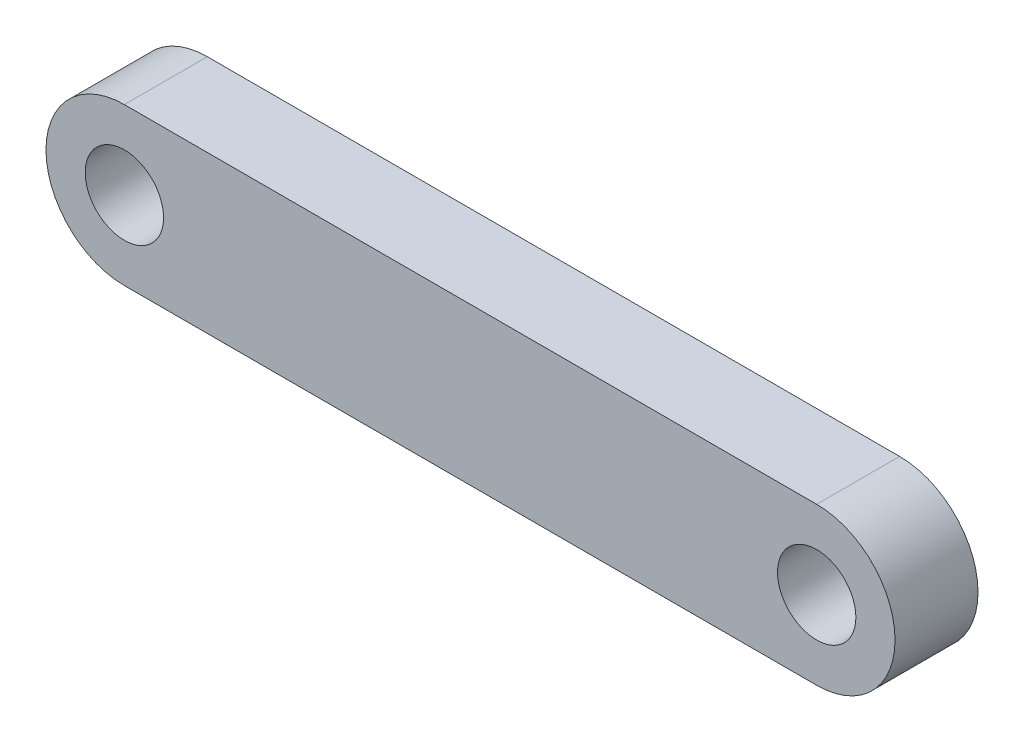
from build123d import *

# Parameters (mm, degrees)
SKETCH1_R           = 6
BOSS_EXTRUDE1_DEPTH = 12.7


with BuildPart() as part:
    # Sketch1 → Boss-Extrude1 (new body)
    with BuildSketch(Plane.XY):
        with BuildLine():
            Line((-53, 12), (53, 12))
            ThreePointArc((53, 12), (65, 0), (53, -12))
            Line((53, -12), (-53, -12))
            ThreePointArc((-53, -12), (-65, 0), (-53, 12))
        make_face()
        with Locations((-53, 0)):
            Circle(SKETCH1_R, mode=Mode.SUBTRACT)
        with Locations((53, 0)):
            Circle(SKETCH1_R, mode=Mode.SUBTRACT)
    extrude(amount=BOSS_EXTRUDE1_DEPTH)


solid = part.part
